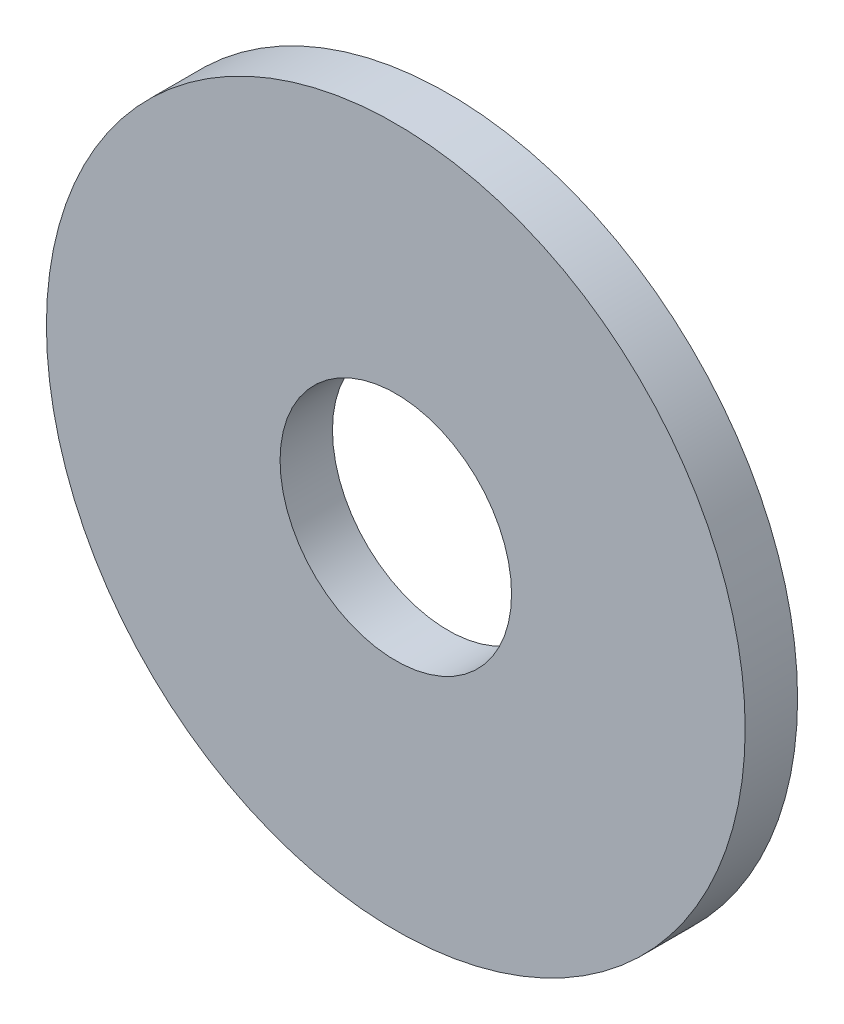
from build123d import *

# Parameters (mm, degrees)
ESQUISSE1_R      = 8
ESQUISSE1_R_2    = 2.65
EXTRUSION1_DEPTH = 1.2


with BuildPart() as part:
    # Esquisse1 → Extrusion1 (new body)
    with BuildSketch(Plane.XY):
        Circle(ESQUISSE1_R)
        Circle(ESQUISSE1_R_2, mode=Mode.SUBTRACT)
    extrude(amount=EXTRUSION1_DEPTH)


solid = part.part
